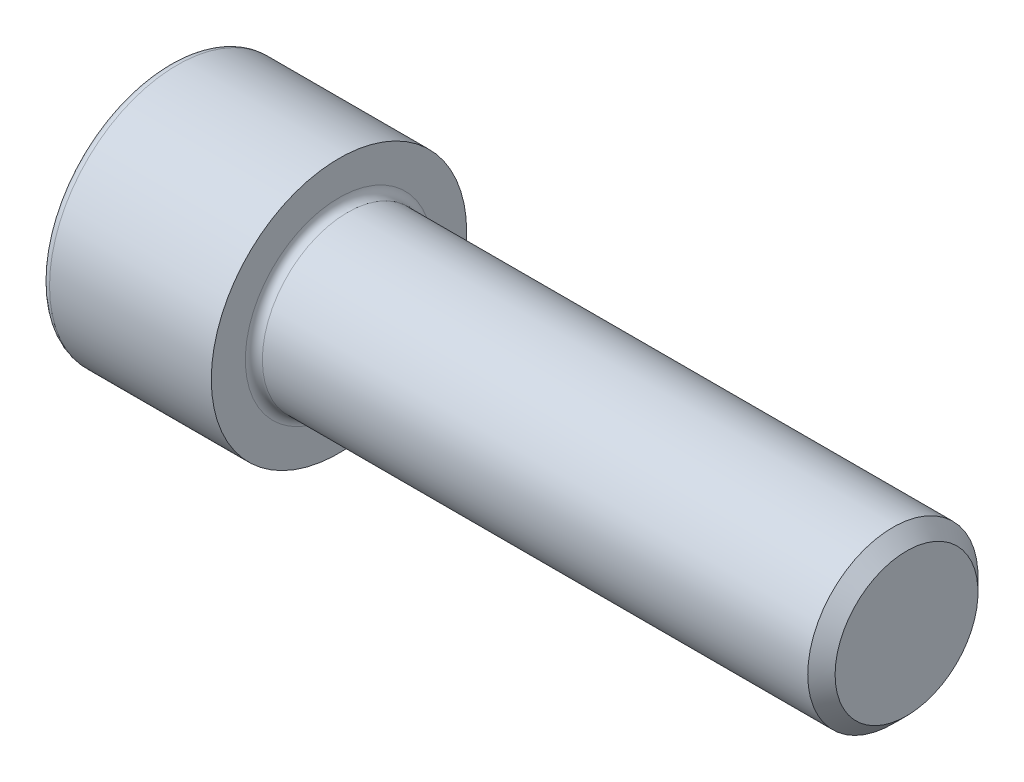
ISO-10303-21;
HEADER;
FILE_DESCRIPTION(('STEP AP214'),'2;1');
FILE_NAME('part.step','',(''),(''),'','','');
FILE_SCHEMA(('AUTOMOTIVE_DESIGN { 1 0 10303 214 1 1 1 1 }'));
ENDSEC;
DATA;
#1=APPLICATION_CONTEXT('core data for automotive mechanical design processes');
#2=APPLICATION_PROTOCOL_DEFINITION('international standard','automotive_design',2000,#1);
#3=PRODUCT_CONTEXT('',#1,'mechanical');
#4=PRODUCT('Part','Part','',(#3));
#5=PRODUCT_RELATED_PRODUCT_CATEGORY('part','',(#4));
#6=PRODUCT_DEFINITION_FORMATION('','',#4);
#7=PRODUCT_DEFINITION_CONTEXT('part definition',#1,'design');
#8=PRODUCT_DEFINITION('design','',#6,#7);
#9=PRODUCT_DEFINITION_SHAPE('','',#8);
#10=(LENGTH_UNIT() NAMED_UNIT(*) SI_UNIT(.MILLI.,.METRE.));
#11=(NAMED_UNIT(*) PLANE_ANGLE_UNIT() SI_UNIT($,.RADIAN.));
#12=(NAMED_UNIT(*) SI_UNIT($,.STERADIAN.) SOLID_ANGLE_UNIT());
#13=UNCERTAINTY_MEASURE_WITH_UNIT(LENGTH_MEASURE(1.E-05),#10,'distance_accuracy_value','');
#14=(GEOMETRIC_REPRESENTATION_CONTEXT(3) GLOBAL_UNCERTAINTY_ASSIGNED_CONTEXT((#13)) GLOBAL_UNIT_ASSIGNED_CONTEXT((#10,
#11,#12)) REPRESENTATION_CONTEXT('',''));
#15=CARTESIAN_POINT('',(0.,0.,0.));
#16=DIRECTION('',(0.,0.,1.));
#17=DIRECTION('',(1.,0.,0.));
#18=AXIS2_PLACEMENT_3D('',#15,#16,#17);
#19=CARTESIAN_POINT('',(0.,0.,0.));
#20=DIRECTION('',(-1.,0.,0.));
#21=DIRECTION('',(0.,0.,1.));
#22=AXIS2_PLACEMENT_3D('',#19,#20,#21);
#23=PLANE('',#22);
#24=DIRECTION('',(0.,-0.499999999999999,0.866025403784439));
#25=VECTOR('',#24,1.);
#26=CARTESIAN_POINT('',(0.,5.83989797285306,0.));
#27=LINE('',#26,#25);
#28=CARTESIAN_POINT('',(0.,5.83989797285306,0.));
#29=VERTEX_POINT('',#28);
#30=CARTESIAN_POINT('',(0.,2.91994898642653,5.0575));
#31=VERTEX_POINT('',#30);
#32=EDGE_CURVE('E254',#29,#31,#27,.T.);
#33=ORIENTED_EDGE('',*,*,#32,.T.);
#34=DIRECTION('',(0.,1.,0.));
#35=VECTOR('',#34,1.);
#36=CARTESIAN_POINT('',(0.,-2.91994898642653,5.0575));
#37=LINE('',#36,#35);
#38=CARTESIAN_POINT('',(0.,-2.91994898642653,5.0575));
#39=VERTEX_POINT('',#38);
#40=EDGE_CURVE('E126',#39,#31,#37,.T.);
#41=ORIENTED_EDGE('',*,*,#40,.F.);
#42=DIRECTION('',(0.,-0.500000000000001,-0.866025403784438));
#43=VECTOR('',#42,1.);
#44=CARTESIAN_POINT('',(0.,-2.91994898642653,5.0575));
#45=LINE('',#44,#43);
#46=CARTESIAN_POINT('',(0.,-5.83989797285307,0.));
#47=VERTEX_POINT('',#46);
#48=EDGE_CURVE('E257',#39,#47,#45,.T.);
#49=ORIENTED_EDGE('',*,*,#48,.T.);
#50=DIRECTION('',(0.,0.499999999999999,-0.866025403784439));
#51=VECTOR('',#50,1.);
#52=CARTESIAN_POINT('',(0.,-5.83989797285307,0.));
#53=LINE('',#52,#51);
#54=CARTESIAN_POINT('',(0.,-2.91994898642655,-5.0575));
#55=VERTEX_POINT('',#54);
#56=EDGE_CURVE('E260',#47,#55,#53,.T.);
#57=ORIENTED_EDGE('',*,*,#56,.T.);
#58=DIRECTION('',(0.,-1.,0.));
#59=VECTOR('',#58,1.);
#60=CARTESIAN_POINT('',(0.,2.91994898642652,-5.05750000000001));
#61=LINE('',#60,#59);
#62=CARTESIAN_POINT('',(0.,2.91994898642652,-5.05750000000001));
#63=VERTEX_POINT('',#62);
#64=EDGE_CURVE('E263',#63,#55,#61,.T.);
#65=ORIENTED_EDGE('',*,*,#64,.F.);
#66=DIRECTION('',(0.,-0.500000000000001,-0.866025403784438));
#67=VECTOR('',#66,1.);
#68=CARTESIAN_POINT('',(0.,5.83989797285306,0.));
#69=LINE('',#68,#67);
#70=EDGE_CURVE('E121',#29,#63,#69,.T.);
#71=ORIENTED_EDGE('',*,*,#70,.F.);
#72=EDGE_LOOP('',(#33,#41,#49,#57,#65,#71));
#73=FACE_BOUND('',#72,.T.);
#74=CARTESIAN_POINT('',(0.,0.,0.));
#75=DIRECTION('',(-1.,0.,0.));
#76=DIRECTION('',(0.,0.,1.));
#77=AXIS2_PLACEMENT_3D('',#74,#75,#76);
#78=CIRCLE('',#77,8.4);
#79=CARTESIAN_POINT('',(0.,0.,8.4));
#80=VERTEX_POINT('',#79);
#81=EDGE_CURVE('E38',#80,#80,#78,.T.);
#82=ORIENTED_EDGE('',*,*,#81,.T.);
#83=EDGE_LOOP('',(#82));
#84=FACE_BOUND('',#83,.T.);
#85=ADVANCED_FACE('F30',(#73,#84),#23,.T.);
#86=CARTESIAN_POINT('',(-31.75,0.,0.));
#87=DIRECTION('',(-1.,0.,0.));
#88=DIRECTION('',(0.,0.,1.));
#89=AXIS2_PLACEMENT_3D('',#86,#87,#88);
#90=CYLINDRICAL_SURFACE('',#89,9.);
#91=CARTESIAN_POINT('',(0.600000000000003,0.,0.));
#92=DIRECTION('',(-1.,0.,0.));
#93=DIRECTION('',(0.,0.,1.));
#94=AXIS2_PLACEMENT_3D('',#91,#92,#93);
#95=CIRCLE('',#94,9.);
#96=CARTESIAN_POINT('',(0.600000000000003,0.,9.));
#97=VERTEX_POINT('',#96);
#98=EDGE_CURVE('E11',#97,#97,#95,.F.);
#99=ORIENTED_EDGE('',*,*,#98,.T.);
#100=EDGE_LOOP('',(#99));
#101=FACE_BOUND('',#100,.T.);
#102=CARTESIAN_POINT('',(12.,0.,0.));
#103=DIRECTION('',(-1.,0.,0.));
#104=DIRECTION('',(0.,0.,1.));
#105=AXIS2_PLACEMENT_3D('',#102,#103,#104);
#106=CIRCLE('',#105,9.);
#107=CARTESIAN_POINT('',(12.,0.,9.));
#108=VERTEX_POINT('',#107);
#109=EDGE_CURVE('E144',#108,#108,#106,.T.);
#110=ORIENTED_EDGE('',*,*,#109,.T.);
#111=EDGE_LOOP('',(#110));
#112=FACE_BOUND('',#111,.T.);
#113=ADVANCED_FACE('F168',(#101,#112),#90,.T.);
#114=CARTESIAN_POINT('',(12.,9.,0.));
#115=DIRECTION('',(1.,0.,0.));
#116=DIRECTION('',(0.,0.,-1.));
#117=AXIS2_PLACEMENT_3D('',#114,#115,#116);
#118=PLANE('',#117);
#119=CARTESIAN_POINT('',(12.,0.,0.));
#120=DIRECTION('',(1.,0.,0.));
#121=DIRECTION('',(0.,0.,-1.));
#122=AXIS2_PLACEMENT_3D('',#119,#120,#121);
#123=CIRCLE('',#122,6.59999999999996);
#124=CARTESIAN_POINT('',(12.,0.,-6.59999999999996));
#125=VERTEX_POINT('',#124);
#126=EDGE_CURVE('E147',#125,#125,#123,.F.);
#127=ORIENTED_EDGE('',*,*,#126,.T.);
#128=EDGE_LOOP('',(#127));
#129=FACE_BOUND('',#128,.T.);
#130=ORIENTED_EDGE('',*,*,#109,.F.);
#131=EDGE_LOOP('',(#130));
#132=FACE_BOUND('',#131,.T.);
#133=ADVANCED_FACE('F174',(#129,#132),#118,.T.);
#134=CARTESIAN_POINT('',(-31.75,0.,0.));
#135=DIRECTION('',(-1.,0.,0.));
#136=DIRECTION('',(0.,0.,1.));
#137=AXIS2_PLACEMENT_3D('',#134,#135,#136);
#138=CYLINDRICAL_SURFACE('',#137,5.99999999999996);
#139=CARTESIAN_POINT('',(12.6,0.,0.));
#140=DIRECTION('',(1.,0.,0.));
#141=DIRECTION('',(0.,0.,-1.));
#142=AXIS2_PLACEMENT_3D('',#139,#140,#141);
#143=CIRCLE('',#142,5.99999999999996);
#144=CARTESIAN_POINT('',(12.6,0.,-5.99999999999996));
#145=VERTEX_POINT('',#144);
#146=EDGE_CURVE('E150',#145,#145,#143,.T.);
#147=ORIENTED_EDGE('',*,*,#146,.T.);
#148=EDGE_LOOP('',(#147));
#149=FACE_BOUND('',#148,.T.);
#150=CARTESIAN_POINT('',(51.0359999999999,0.,0.));
#151=DIRECTION('',(-1.,0.,0.));
#152=DIRECTION('',(0.,0.,1.));
#153=AXIS2_PLACEMENT_3D('',#150,#151,#152);
#154=CIRCLE('',#153,5.99999999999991);
#155=CARTESIAN_POINT('',(51.0359999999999,0.,5.99999999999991));
#156=VERTEX_POINT('',#155);
#157=EDGE_CURVE('E141',#156,#156,#154,.T.);
#158=ORIENTED_EDGE('',*,*,#157,.T.);
#159=EDGE_LOOP('',(#158));
#160=FACE_BOUND('',#159,.T.);
#161=ADVANCED_FACE('F180',(#149,#160),#138,.T.);
#162=CARTESIAN_POINT('',(52.,0.,0.));
#163=DIRECTION('',(-1.,0.,0.));
#164=DIRECTION('',(0.,0.,1.));
#165=AXIS2_PLACEMENT_3D('',#162,#163,#164);
#166=CONICAL_SURFACE('',#165,5.036,0.785398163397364);
#167=ORIENTED_EDGE('',*,*,#157,.F.);
#168=EDGE_LOOP('',(#167));
#169=FACE_BOUND('',#168,.T.);
#170=CARTESIAN_POINT('',(52.,0.,0.));
#171=DIRECTION('',(-1.,0.,0.));
#172=DIRECTION('',(0.,0.,1.));
#173=AXIS2_PLACEMENT_3D('',#170,#171,#172);
#174=CIRCLE('',#173,5.036);
#175=CARTESIAN_POINT('',(52.,0.,5.036));
#176=VERTEX_POINT('',#175);
#177=EDGE_CURVE('E137',#176,#176,#174,.T.);
#178=ORIENTED_EDGE('',*,*,#177,.T.);
#179=EDGE_LOOP('',(#178));
#180=FACE_BOUND('',#179,.T.);
#181=ADVANCED_FACE('F184',(#169,#180),#166,.T.);
#182=CARTESIAN_POINT('',(52.,5.036,0.));
#183=DIRECTION('',(1.,0.,0.));
#184=DIRECTION('',(0.,0.,-1.));
#185=AXIS2_PLACEMENT_3D('',#182,#183,#184);
#186=PLANE('',#185);
#187=ORIENTED_EDGE('',*,*,#177,.F.);
#188=EDGE_LOOP('',(#187));
#189=FACE_BOUND('',#188,.T.);
#190=ADVANCED_FACE('F164',(#189),#186,.T.);
#191=CARTESIAN_POINT('',(12.6,0.,0.));
#192=DIRECTION('',(1.,0.,0.));
#193=DIRECTION('',(0.,0.,-1.));
#194=AXIS2_PLACEMENT_3D('',#191,#192,#193);
#195=TOROIDAL_SURFACE('',#194,6.59999999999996,0.6);
#196=ORIENTED_EDGE('',*,*,#146,.F.);
#197=EDGE_LOOP('',(#196));
#198=FACE_BOUND('',#197,.T.);
#199=ORIENTED_EDGE('',*,*,#126,.F.);
#200=EDGE_LOOP('',(#199));
#201=FACE_BOUND('',#200,.T.);
#202=ADVANCED_FACE('F157',(#198,#201),#195,.F.);
#203=CARTESIAN_POINT('',(0.600000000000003,0.,0.));
#204=DIRECTION('',(-1.,0.,0.));
#205=DIRECTION('',(0.,0.,1.));
#206=AXIS2_PLACEMENT_3D('',#203,#204,#205);
#207=TOROIDAL_SURFACE('',#206,8.4,0.6);
#208=ORIENTED_EDGE('',*,*,#98,.F.);
#209=EDGE_LOOP('',(#208));
#210=FACE_BOUND('',#209,.T.);
#211=ORIENTED_EDGE('',*,*,#81,.F.);
#212=EDGE_LOOP('',(#211));
#213=FACE_BOUND('',#212,.T.);
#214=ADVANCED_FACE('F32',(#210,#213),#207,.T.);
#215=CARTESIAN_POINT('',(6.,5.83989797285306,0.));
#216=DIRECTION('',(0.,-0.866025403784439,-0.499999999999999));
#217=DIRECTION('',(0.,0.499999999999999,-0.866025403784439));
#218=AXIS2_PLACEMENT_3D('',#215,#216,#217);
#219=PLANE('',#218);
#220=ORIENTED_EDGE('',*,*,#32,.F.);
#221=DIRECTION('',(-1.,0.,0.));
#222=VECTOR('',#221,1.);
#223=CARTESIAN_POINT('',(6.,5.83989797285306,0.));
#224=LINE('',#223,#222);
#225=CARTESIAN_POINT('',(6.,5.83989797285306,0.));
#226=VERTEX_POINT('',#225);
#227=EDGE_CURVE('E244',#226,#29,#224,.T.);
#228=ORIENTED_EDGE('',*,*,#227,.F.);
#229=DIRECTION('',(0.,-0.499999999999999,0.866025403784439));
#230=VECTOR('',#229,1.);
#231=CARTESIAN_POINT('',(6.,5.83989797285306,0.));
#232=LINE('',#231,#230);
#233=CARTESIAN_POINT('',(6.,4.3799234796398,2.52875));
#234=VERTEX_POINT('',#233);
#235=EDGE_CURVE('E113',#226,#234,#232,.T.);
#236=ORIENTED_EDGE('',*,*,#235,.T.);
#237=CARTESIAN_POINT('',(6.,2.91994898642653,5.0575));
#238=VERTEX_POINT('',#237);
#239=EDGE_CURVE('E104',#234,#238,#232,.T.);
#240=ORIENTED_EDGE('',*,*,#239,.T.);
#241=DIRECTION('',(-1.,0.,0.));
#242=VECTOR('',#241,1.);
#243=CARTESIAN_POINT('',(6.,2.91994898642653,5.0575));
#244=LINE('',#243,#242);
#245=EDGE_CURVE('E118',#238,#31,#244,.T.);
#246=ORIENTED_EDGE('',*,*,#245,.T.);
#247=EDGE_LOOP('',(#220,#228,#236,#240,#246));
#248=FACE_BOUND('',#247,.T.);
#249=ADVANCED_FACE('F117',(#248),#219,.T.);
#250=CARTESIAN_POINT('',(6.,-2.91994898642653,5.0575));
#251=DIRECTION('',(0.,0.,1.));
#252=DIRECTION('',(0.,-1.,0.));
#253=AXIS2_PLACEMENT_3D('',#250,#251,#252);
#254=PLANE('',#253);
#255=ORIENTED_EDGE('',*,*,#40,.T.);
#256=ORIENTED_EDGE('',*,*,#245,.F.);
#257=DIRECTION('',(0.,1.,0.));
#258=VECTOR('',#257,1.);
#259=CARTESIAN_POINT('',(6.,-2.91994898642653,5.0575));
#260=LINE('',#259,#258);
#261=CARTESIAN_POINT('',(6.,0.,5.0575));
#262=VERTEX_POINT('',#261);
#263=EDGE_CURVE('E101',#262,#238,#260,.T.);
#264=ORIENTED_EDGE('',*,*,#263,.F.);
#265=CARTESIAN_POINT('',(6.,-2.91994898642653,5.0575));
#266=VERTEX_POINT('',#265);
#267=EDGE_CURVE('E112',#266,#262,#260,.T.);
#268=ORIENTED_EDGE('',*,*,#267,.F.);
#269=DIRECTION('',(-1.,0.,0.));
#270=VECTOR('',#269,1.);
#271=CARTESIAN_POINT('',(6.,-2.91994898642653,5.0575));
#272=LINE('',#271,#270);
#273=EDGE_CURVE('E128',#266,#39,#272,.T.);
#274=ORIENTED_EDGE('',*,*,#273,.T.);
#275=EDGE_LOOP('',(#255,#256,#264,#268,#274));
#276=FACE_BOUND('',#275,.T.);
#277=ADVANCED_FACE('F123',(#276),#254,.F.);
#278=CARTESIAN_POINT('',(6.,-2.91994898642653,5.0575));
#279=DIRECTION('',(0.,0.866025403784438,-0.500000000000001));
#280=DIRECTION('',(0.,0.500000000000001,0.866025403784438));
#281=AXIS2_PLACEMENT_3D('',#278,#279,#280);
#282=PLANE('',#281);
#283=ORIENTED_EDGE('',*,*,#48,.F.);
#284=ORIENTED_EDGE('',*,*,#273,.F.);
#285=DIRECTION('',(0.,-0.500000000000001,-0.866025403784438));
#286=VECTOR('',#285,1.);
#287=CARTESIAN_POINT('',(6.,-2.91994898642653,5.0575));
#288=LINE('',#287,#286);
#289=CARTESIAN_POINT('',(6.,-4.3799234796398,2.52875000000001));
#290=VERTEX_POINT('',#289);
#291=EDGE_CURVE('E283',#266,#290,#288,.T.);
#292=ORIENTED_EDGE('',*,*,#291,.T.);
#293=CARTESIAN_POINT('',(6.,-5.83989797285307,0.));
#294=VERTEX_POINT('',#293);
#295=EDGE_CURVE('E272',#290,#294,#288,.T.);
#296=ORIENTED_EDGE('',*,*,#295,.T.);
#297=DIRECTION('',(-1.,0.,0.));
#298=VECTOR('',#297,1.);
#299=CARTESIAN_POINT('',(6.,-5.83989797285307,0.));
#300=LINE('',#299,#298);
#301=EDGE_CURVE('E133',#294,#47,#300,.T.);
#302=ORIENTED_EDGE('',*,*,#301,.T.);
#303=EDGE_LOOP('',(#283,#284,#292,#296,#302));
#304=FACE_BOUND('',#303,.T.);
#305=ADVANCED_FACE('F198',(#304),#282,.T.);
#306=CARTESIAN_POINT('',(6.,-5.83989797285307,0.));
#307=DIRECTION('',(0.,0.866025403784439,0.499999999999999));
#308=DIRECTION('',(0.,-0.499999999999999,0.866025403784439));
#309=AXIS2_PLACEMENT_3D('',#306,#307,#308);
#310=PLANE('',#309);
#311=ORIENTED_EDGE('',*,*,#56,.F.);
#312=ORIENTED_EDGE('',*,*,#301,.F.);
#313=DIRECTION('',(0.,0.499999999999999,-0.866025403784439));
#314=VECTOR('',#313,1.);
#315=CARTESIAN_POINT('',(6.,-5.83989797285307,0.));
#316=LINE('',#315,#314);
#317=CARTESIAN_POINT('',(6.,-4.37992347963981,-2.52875));
#318=VERTEX_POINT('',#317);
#319=EDGE_CURVE('E250',#294,#318,#316,.T.);
#320=ORIENTED_EDGE('',*,*,#319,.T.);
#321=CARTESIAN_POINT('',(6.,-2.91994898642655,-5.0575));
#322=VERTEX_POINT('',#321);
#323=EDGE_CURVE('E282',#318,#322,#316,.T.);
#324=ORIENTED_EDGE('',*,*,#323,.T.);
#325=DIRECTION('',(-1.,0.,0.));
#326=VECTOR('',#325,1.);
#327=CARTESIAN_POINT('',(6.,-2.91994898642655,-5.0575));
#328=LINE('',#327,#326);
#329=EDGE_CURVE('E243',#322,#55,#328,.T.);
#330=ORIENTED_EDGE('',*,*,#329,.T.);
#331=EDGE_LOOP('',(#311,#312,#320,#324,#330));
#332=FACE_BOUND('',#331,.T.);
#333=ADVANCED_FACE('F201',(#332),#310,.T.);
#334=CARTESIAN_POINT('',(6.,2.91994898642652,-5.05750000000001));
#335=DIRECTION('',(0.,0.,-1.));
#336=DIRECTION('',(0.,1.,0.));
#337=AXIS2_PLACEMENT_3D('',#334,#335,#336);
#338=PLANE('',#337);
#339=ORIENTED_EDGE('',*,*,#64,.T.);
#340=ORIENTED_EDGE('',*,*,#329,.F.);
#341=DIRECTION('',(0.,-1.,0.));
#342=VECTOR('',#341,1.);
#343=CARTESIAN_POINT('',(6.,2.91994898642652,-5.05750000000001));
#344=LINE('',#343,#342);
#345=CARTESIAN_POINT('',(6.,0.,-5.0575));
#346=VERTEX_POINT('',#345);
#347=EDGE_CURVE('E247',#346,#322,#344,.T.);
#348=ORIENTED_EDGE('',*,*,#347,.F.);
#349=CARTESIAN_POINT('',(6.,2.91994898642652,-5.05750000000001));
#350=VERTEX_POINT('',#349);
#351=EDGE_CURVE('E45',#350,#346,#344,.T.);
#352=ORIENTED_EDGE('',*,*,#351,.F.);
#353=DIRECTION('',(-1.,0.,0.));
#354=VECTOR('',#353,1.);
#355=CARTESIAN_POINT('',(6.,2.91994898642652,-5.05750000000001));
#356=LINE('',#355,#354);
#357=EDGE_CURVE('E240',#350,#63,#356,.T.);
#358=ORIENTED_EDGE('',*,*,#357,.T.);
#359=EDGE_LOOP('',(#339,#340,#348,#352,#358));
#360=FACE_BOUND('',#359,.T.);
#361=ADVANCED_FACE('F205',(#360),#338,.F.);
#362=CARTESIAN_POINT('',(6.,5.83989797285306,0.));
#363=DIRECTION('',(0.,0.866025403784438,-0.500000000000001));
#364=DIRECTION('',(0.,0.500000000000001,0.866025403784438));
#365=AXIS2_PLACEMENT_3D('',#362,#363,#364);
#366=PLANE('',#365);
#367=ORIENTED_EDGE('',*,*,#70,.T.);
#368=ORIENTED_EDGE('',*,*,#357,.F.);
#369=DIRECTION('',(0.,-0.500000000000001,-0.866025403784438));
#370=VECTOR('',#369,1.);
#371=CARTESIAN_POINT('',(6.,5.83989797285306,0.));
#372=LINE('',#371,#370);
#373=CARTESIAN_POINT('',(6.,4.37992347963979,-2.52875000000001));
#374=VERTEX_POINT('',#373);
#375=EDGE_CURVE('E230',#374,#350,#372,.T.);
#376=ORIENTED_EDGE('',*,*,#375,.F.);
#377=EDGE_CURVE('E236',#226,#374,#372,.T.);
#378=ORIENTED_EDGE('',*,*,#377,.F.);
#379=ORIENTED_EDGE('',*,*,#227,.T.);
#380=EDGE_LOOP('',(#367,#368,#376,#378,#379));
#381=FACE_BOUND('',#380,.T.);
#382=ADVANCED_FACE('F209',(#381),#366,.F.);
#383=CARTESIAN_POINT('',(6.,5.83989797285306,0.));
#384=DIRECTION('',(1.,0.,0.));
#385=DIRECTION('',(0.,0.,-1.));
#386=AXIS2_PLACEMENT_3D('',#383,#384,#385);
#387=PLANE('',#386);
#388=ORIENTED_EDGE('',*,*,#347,.T.);
#389=ORIENTED_EDGE('',*,*,#323,.F.);
#390=CARTESIAN_POINT('',(6.,0.,0.));
#391=DIRECTION('',(-1.,0.,0.));
#392=DIRECTION('',(0.,0.,1.));
#393=AXIS2_PLACEMENT_3D('',#390,#391,#392);
#394=CIRCLE('',#393,5.0575);
#395=EDGE_CURVE('E278',#346,#318,#394,.T.);
#396=ORIENTED_EDGE('',*,*,#395,.F.);
#397=EDGE_LOOP('',(#388,#389,#396));
#398=FACE_BOUND('',#397,.T.);
#399=ADVANCED_FACE('F213',(#398),#387,.F.);
#400=ORIENTED_EDGE('',*,*,#319,.F.);
#401=ORIENTED_EDGE('',*,*,#295,.F.);
#402=EDGE_CURVE('E131',#318,#290,#394,.T.);
#403=ORIENTED_EDGE('',*,*,#402,.F.);
#404=EDGE_LOOP('',(#400,#401,#403));
#405=FACE_BOUND('',#404,.T.);
#406=ADVANCED_FACE('F216',(#405),#387,.F.);
#407=ORIENTED_EDGE('',*,*,#291,.F.);
#408=ORIENTED_EDGE('',*,*,#267,.T.);
#409=EDGE_CURVE('E127',#290,#262,#394,.T.);
#410=ORIENTED_EDGE('',*,*,#409,.F.);
#411=EDGE_LOOP('',(#407,#408,#410));
#412=FACE_BOUND('',#411,.T.);
#413=ADVANCED_FACE('F221',(#412),#387,.F.);
#414=ORIENTED_EDGE('',*,*,#263,.T.);
#415=ORIENTED_EDGE('',*,*,#239,.F.);
#416=EDGE_CURVE('E107',#262,#234,#394,.T.);
#417=ORIENTED_EDGE('',*,*,#416,.F.);
#418=EDGE_LOOP('',(#414,#415,#417));
#419=FACE_BOUND('',#418,.T.);
#420=ADVANCED_FACE('F103',(#419),#387,.F.);
#421=ORIENTED_EDGE('',*,*,#235,.F.);
#422=ORIENTED_EDGE('',*,*,#377,.T.);
#423=EDGE_CURVE('E138',#234,#374,#394,.T.);
#424=ORIENTED_EDGE('',*,*,#423,.F.);
#425=EDGE_LOOP('',(#421,#422,#424));
#426=FACE_BOUND('',#425,.T.);
#427=ADVANCED_FACE('F224',(#426),#387,.F.);
#428=ORIENTED_EDGE('',*,*,#375,.T.);
#429=ORIENTED_EDGE('',*,*,#351,.T.);
#430=EDGE_CURVE('E233',#374,#346,#394,.T.);
#431=ORIENTED_EDGE('',*,*,#430,.F.);
#432=EDGE_LOOP('',(#428,#429,#431));
#433=FACE_BOUND('',#432,.T.);
#434=ADVANCED_FACE('F194',(#433),#387,.F.);
#435=CARTESIAN_POINT('',(6.,0.,0.));
#436=DIRECTION('',(-1.,0.,0.));
#437=DIRECTION('',(0.,0.,1.));
#438=AXIS2_PLACEMENT_3D('',#435,#436,#437);
#439=CONICAL_SURFACE('',#438,5.0575,1.04719755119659);
#440=CARTESIAN_POINT('',(8.91994898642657,0.,0.));
#441=VERTEX_POINT('',#440);
#442=VERTEX_LOOP('',#441);
#443=FACE_BOUND('',#442,.T.);
#444=ORIENTED_EDGE('',*,*,#416,.T.);
#445=ORIENTED_EDGE('',*,*,#423,.T.);
#446=ORIENTED_EDGE('',*,*,#430,.T.);
#447=ORIENTED_EDGE('',*,*,#395,.T.);
#448=ORIENTED_EDGE('',*,*,#402,.T.);
#449=ORIENTED_EDGE('',*,*,#409,.T.);
#450=EDGE_LOOP('',(#444,#445,#446,#447,#448,#449));
#451=FACE_BOUND('',#450,.T.);
#452=ADVANCED_FACE('F192',(#443,#451),#439,.F.);
#453=CLOSED_SHELL('',(#85,#113,#133,#161,#181,#190,#202,#214,#249,#277,#305,#333,#361,#382,#399,
#406,#413,#420,#427,#434,#452));
#454=MANIFOLD_SOLID_BREP('B2',#453);
#455=ADVANCED_BREP_SHAPE_REPRESENTATION('',(#18,#454),#14);
#456=SHAPE_DEFINITION_REPRESENTATION(#9,#455);
ENDSEC;
END-ISO-10303-21;
